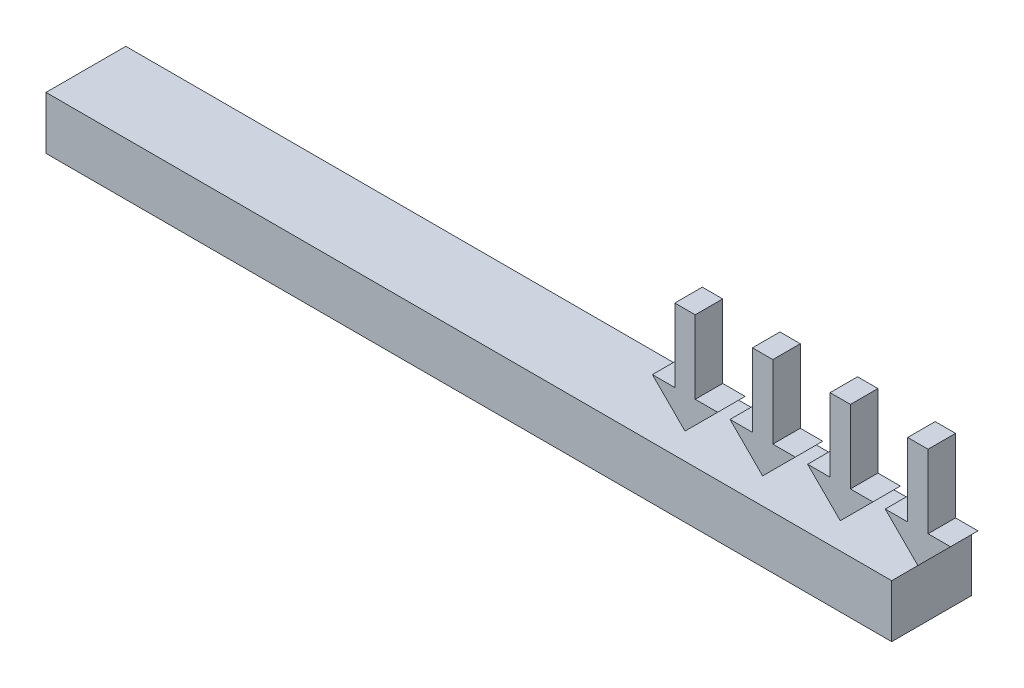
from build123d import *

# Parameters (mm, degrees)
SKETCH1_W       = 406.4
SKETCH1_H       = 25.4
EXTRUDE1_DEPTH  = 19.177
EXTRUDE2_DEPTH  = 6.604
LPATTERN2_COUNT = 4
LPATTERN2_PITCH = 37.3


with BuildPart() as part:
    # Sketch1 → Extrude1 (new, symmetric)
    with BuildSketch(Plane.XY):
        with Locations((203.2, 12.7)):
            Rectangle(SKETCH1_W, SKETCH1_H)
    extrude(amount=EXTRUDE1_DEPTH, both=True)


with BuildPart() as body_2:
    # Sketch2 → Extrude2 (new, symmetric)
    with BuildSketch(Plane.XY):
        Polygon((401.502018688, 41.082547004), (390.717452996, 41.082547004), (406.4, 25.4), (422.082547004, 41.082547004), (411.297981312, 41.082547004), (411.297981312, 76.265437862), (401.502018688, 76.265437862), align=None)
    extrude(amount=EXTRUDE2_DEPTH, both=True)


with BuildPart() as lpattern2_1:
    # LPattern2: pattern copy
    add(body_2.part.moved(Location(Vector(-1, 0, 0) * (1 * LPATTERN2_PITCH))))


with BuildPart() as lpattern2_2:
    # LPattern2: pattern copy
    add(body_2.part.moved(Location(Vector(-1, 0, 0) * (2 * LPATTERN2_PITCH))))


with BuildPart() as lpattern2_3:
    # LPattern2: pattern copy
    add(body_2.part.moved(Location(Vector(-1, 0, 0) * (3 * LPATTERN2_PITCH))))


solid = Compound([part.part, body_2.part, lpattern2_1.part, lpattern2_2.part, lpattern2_3.part])
